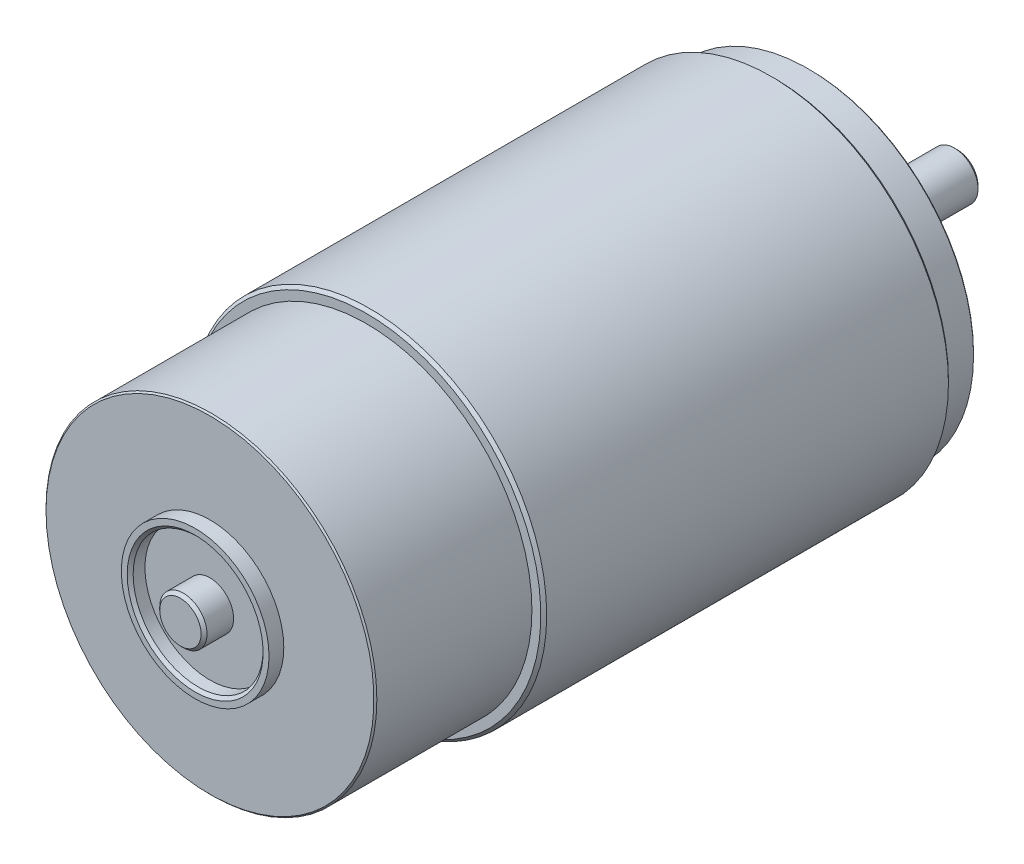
ISO-10303-21;
HEADER;
FILE_DESCRIPTION(('STEP AP214'),'2;1');
FILE_NAME('part.step','',(''),(''),'','','');
FILE_SCHEMA(('AUTOMOTIVE_DESIGN { 1 0 10303 214 1 1 1 1 }'));
ENDSEC;
DATA;
#1=APPLICATION_CONTEXT('core data for automotive mechanical design processes');
#2=APPLICATION_PROTOCOL_DEFINITION('international standard','automotive_design',2000,#1);
#3=PRODUCT_CONTEXT('',#1,'mechanical');
#4=PRODUCT('Part','Part','',(#3));
#5=PRODUCT_RELATED_PRODUCT_CATEGORY('part','',(#4));
#6=PRODUCT_DEFINITION_FORMATION('','',#4);
#7=PRODUCT_DEFINITION_CONTEXT('part definition',#1,'design');
#8=PRODUCT_DEFINITION('design','',#6,#7);
#9=PRODUCT_DEFINITION_SHAPE('','',#8);
#10=(LENGTH_UNIT() NAMED_UNIT(*) SI_UNIT(.MILLI.,.METRE.));
#11=(NAMED_UNIT(*) PLANE_ANGLE_UNIT() SI_UNIT($,.RADIAN.));
#12=(NAMED_UNIT(*) SI_UNIT($,.STERADIAN.) SOLID_ANGLE_UNIT());
#13=UNCERTAINTY_MEASURE_WITH_UNIT(LENGTH_MEASURE(1.E-05),#10,'distance_accuracy_value','');
#14=(GEOMETRIC_REPRESENTATION_CONTEXT(3) GLOBAL_UNCERTAINTY_ASSIGNED_CONTEXT((#13)) GLOBAL_UNIT_ASSIGNED_CONTEXT((#10,
#11,#12)) REPRESENTATION_CONTEXT('',''));
#15=CARTESIAN_POINT('',(0.,0.,0.));
#16=DIRECTION('',(0.,0.,1.));
#17=DIRECTION('',(1.,0.,0.));
#18=AXIS2_PLACEMENT_3D('',#15,#16,#17);
#19=CARTESIAN_POINT('',(-8.53793066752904,0.,81.0483408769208));
#20=DIRECTION('',(0.,0.,-1.));
#21=DIRECTION('',(-1.,0.,0.));
#22=AXIS2_PLACEMENT_3D('',#19,#20,#21);
#23=PLANE('',#22);
#24=CARTESIAN_POINT('',(-8.53793066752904,0.,81.0483408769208));
#25=DIRECTION('',(0.,0.,-1.));
#26=DIRECTION('',(-1.,0.,0.));
#27=AXIS2_PLACEMENT_3D('',#24,#25,#26);
#28=CIRCLE('',#27,3.49999999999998);
#29=CARTESIAN_POINT('',(-12.037930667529,0.,81.0483408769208));
#30=VERTEX_POINT('',#29);
#31=EDGE_CURVE('E51',#30,#30,#28,.F.);
#32=ORIENTED_EDGE('',*,*,#31,.T.);
#33=EDGE_LOOP('',(#32));
#34=FACE_BOUND('',#33,.T.);
#35=ADVANCED_FACE('F28',(#34),#23,.F.);
#36=CARTESIAN_POINT('',(-8.53793066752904,0.,81.0483408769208));
#37=DIRECTION('',(0.,0.,1.));
#38=DIRECTION('',(1.,0.,0.));
#39=AXIS2_PLACEMENT_3D('',#36,#37,#38);
#40=CYLINDRICAL_SURFACE('',#39,4.);
#41=CARTESIAN_POINT('',(-8.53793066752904,0.,80.5483408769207));
#42=DIRECTION('',(0.,0.,-1.));
#43=DIRECTION('',(-1.,0.,0.));
#44=AXIS2_PLACEMENT_3D('',#41,#42,#43);
#45=CIRCLE('',#44,4.);
#46=CARTESIAN_POINT('',(-12.537930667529,0.,80.5483408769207));
#47=VERTEX_POINT('',#46);
#48=EDGE_CURVE('E48',#47,#47,#45,.T.);
#49=ORIENTED_EDGE('',*,*,#48,.T.);
#50=EDGE_LOOP('',(#49));
#51=FACE_BOUND('',#50,.T.);
#52=CARTESIAN_POINT('',(-8.53793066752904,0.,76.0483408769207));
#53=DIRECTION('',(0.,0.,1.));
#54=DIRECTION('',(1.,0.,0.));
#55=AXIS2_PLACEMENT_3D('',#52,#53,#54);
#56=CIRCLE('',#55,4.);
#57=CARTESIAN_POINT('',(-4.53793066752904,0.,76.0483408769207));
#58=VERTEX_POINT('',#57);
#59=EDGE_CURVE('E84',#58,#58,#56,.T.);
#60=ORIENTED_EDGE('',*,*,#59,.T.);
#61=EDGE_LOOP('',(#60));
#62=FACE_BOUND('',#61,.T.);
#63=ADVANCED_FACE('F133',(#51,#62),#40,.T.);
#64=CARTESIAN_POINT('',(-12.537930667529,0.,76.0483408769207));
#65=DIRECTION('',(0.,0.,-1.));
#66=DIRECTION('',(-1.,0.,0.));
#67=AXIS2_PLACEMENT_3D('',#64,#65,#66);
#68=PLANE('',#67);
#69=ORIENTED_EDGE('',*,*,#59,.F.);
#70=EDGE_LOOP('',(#69));
#71=FACE_BOUND('',#70,.T.);
#72=CARTESIAN_POINT('',(-8.53793066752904,0.,76.0483408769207));
#73=DIRECTION('',(0.,0.,1.));
#74=DIRECTION('',(1.,0.,0.));
#75=AXIS2_PLACEMENT_3D('',#72,#73,#74);
#76=CIRCLE('',#75,11.);
#77=CARTESIAN_POINT('',(2.46206933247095,0.,76.0483408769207));
#78=VERTEX_POINT('',#77);
#79=EDGE_CURVE('E87',#78,#78,#76,.T.);
#80=ORIENTED_EDGE('',*,*,#79,.T.);
#81=EDGE_LOOP('',(#80));
#82=FACE_BOUND('',#81,.T.);
#83=ADVANCED_FACE('F139',(#71,#82),#68,.F.);
#84=CARTESIAN_POINT('',(-8.53793066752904,0.,81.0483408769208));
#85=DIRECTION('',(0.,0.,1.));
#86=DIRECTION('',(1.,0.,0.));
#87=AXIS2_PLACEMENT_3D('',#84,#85,#86);
#88=CYLINDRICAL_SURFACE('',#87,11.);
#89=CARTESIAN_POINT('',(-8.53793066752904,0.,78.0483408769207));
#90=DIRECTION('',(0.,0.,-1.));
#91=DIRECTION('',(-1.,0.,0.));
#92=AXIS2_PLACEMENT_3D('',#89,#90,#91);
#93=CIRCLE('',#92,11.);
#94=CARTESIAN_POINT('',(-19.537930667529,0.,78.0483408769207));
#95=VERTEX_POINT('',#94);
#96=EDGE_CURVE('E69',#95,#95,#93,.F.);
#97=ORIENTED_EDGE('',*,*,#96,.T.);
#98=EDGE_LOOP('',(#97));
#99=FACE_BOUND('',#98,.T.);
#100=ORIENTED_EDGE('',*,*,#79,.F.);
#101=EDGE_LOOP('',(#100));
#102=FACE_BOUND('',#101,.T.);
#103=ADVANCED_FACE('F192',(#99,#102),#88,.F.);
#104=CARTESIAN_POINT('',(-19.537930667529,0.,78.5483408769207));
#105=DIRECTION('',(0.,0.,-1.));
#106=DIRECTION('',(-1.,0.,0.));
#107=AXIS2_PLACEMENT_3D('',#104,#105,#106);
#108=PLANE('',#107);
#109=CARTESIAN_POINT('',(-8.53793066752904,0.,78.5483408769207));
#110=DIRECTION('',(0.,0.,-1.));
#111=DIRECTION('',(-1.,0.,0.));
#112=AXIS2_PLACEMENT_3D('',#109,#110,#111);
#113=CIRCLE('',#112,11.5);
#114=CARTESIAN_POINT('',(-20.037930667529,0.,78.5483408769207));
#115=VERTEX_POINT('',#114);
#116=EDGE_CURVE('E66',#115,#115,#113,.T.);
#117=ORIENTED_EDGE('',*,*,#116,.T.);
#118=EDGE_LOOP('',(#117));
#119=FACE_BOUND('',#118,.T.);
#120=CARTESIAN_POINT('',(-8.53793066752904,0.,78.5483408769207));
#121=DIRECTION('',(0.,0.,1.));
#122=DIRECTION('',(1.,0.,0.));
#123=AXIS2_PLACEMENT_3D('',#120,#121,#122);
#124=CIRCLE('',#123,12.5);
#125=CARTESIAN_POINT('',(3.96206933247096,0.,78.5483408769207));
#126=VERTEX_POINT('',#125);
#127=EDGE_CURVE('E90',#126,#126,#124,.T.);
#128=ORIENTED_EDGE('',*,*,#127,.T.);
#129=EDGE_LOOP('',(#128));
#130=FACE_BOUND('',#129,.T.);
#131=ADVANCED_FACE('F186',(#119,#130),#108,.F.);
#132=CARTESIAN_POINT('',(-8.53793066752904,0.,81.0483408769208));
#133=DIRECTION('',(0.,0.,1.));
#134=DIRECTION('',(1.,0.,0.));
#135=AXIS2_PLACEMENT_3D('',#132,#133,#134);
#136=CYLINDRICAL_SURFACE('',#135,12.5);
#137=ORIENTED_EDGE('',*,*,#127,.F.);
#138=EDGE_LOOP('',(#137));
#139=FACE_BOUND('',#138,.T.);
#140=CARTESIAN_POINT('',(-8.53793066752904,0.,76.0483408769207));
#141=DIRECTION('',(0.,0.,1.));
#142=DIRECTION('',(1.,0.,0.));
#143=AXIS2_PLACEMENT_3D('',#140,#141,#142);
#144=CIRCLE('',#143,12.5);
#145=CARTESIAN_POINT('',(3.96206933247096,0.,76.0483408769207));
#146=VERTEX_POINT('',#145);
#147=EDGE_CURVE('E93',#146,#146,#144,.T.);
#148=ORIENTED_EDGE('',*,*,#147,.T.);
#149=EDGE_LOOP('',(#148));
#150=FACE_BOUND('',#149,.T.);
#151=ADVANCED_FACE('F181',(#139,#150),#136,.T.);
#152=CARTESIAN_POINT('',(-21.037930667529,0.,76.0483408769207));
#153=DIRECTION('',(0.,0.,-1.));
#154=DIRECTION('',(-1.,0.,0.));
#155=AXIS2_PLACEMENT_3D('',#152,#153,#154);
#156=PLANE('',#155);
#157=CARTESIAN_POINT('',(-8.53793066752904,0.,76.0483408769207));
#158=DIRECTION('',(0.,0.,-1.));
#159=DIRECTION('',(-1.,0.,0.));
#160=AXIS2_PLACEMENT_3D('',#157,#158,#159);
#161=CIRCLE('',#160,27.75);
#162=CARTESIAN_POINT('',(-36.287930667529,0.,76.0483408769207));
#163=VERTEX_POINT('',#162);
#164=EDGE_CURVE('E43',#163,#163,#161,.F.);
#165=ORIENTED_EDGE('',*,*,#164,.T.);
#166=EDGE_LOOP('',(#165));
#167=FACE_BOUND('',#166,.T.);
#168=ORIENTED_EDGE('',*,*,#147,.F.);
#169=EDGE_LOOP('',(#168));
#170=FACE_BOUND('',#169,.T.);
#171=ADVANCED_FACE('F177',(#167,#170),#156,.F.);
#172=CARTESIAN_POINT('',(-8.53793066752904,0.,81.0483408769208));
#173=DIRECTION('',(0.,0.,1.));
#174=DIRECTION('',(1.,0.,0.));
#175=AXIS2_PLACEMENT_3D('',#172,#173,#174);
#176=CYLINDRICAL_SURFACE('',#175,28.);
#177=CARTESIAN_POINT('',(-8.53793066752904,0.,75.7983408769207));
#178=DIRECTION('',(0.,0.,-1.));
#179=DIRECTION('',(-1.,0.,0.));
#180=AXIS2_PLACEMENT_3D('',#177,#178,#179);
#181=CIRCLE('',#180,28.);
#182=CARTESIAN_POINT('',(-36.537930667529,0.,75.7983408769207));
#183=VERTEX_POINT('',#182);
#184=EDGE_CURVE('E39',#183,#183,#181,.T.);
#185=ORIENTED_EDGE('',*,*,#184,.T.);
#186=EDGE_LOOP('',(#185));
#187=FACE_BOUND('',#186,.T.);
#188=CARTESIAN_POINT('',(-8.53793066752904,0.,49.5483408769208));
#189=DIRECTION('',(0.,0.,1.));
#190=DIRECTION('',(1.,0.,0.));
#191=AXIS2_PLACEMENT_3D('',#188,#189,#190);
#192=CIRCLE('',#191,28.);
#193=CARTESIAN_POINT('',(19.462069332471,0.,49.5483408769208));
#194=VERTEX_POINT('',#193);
#195=EDGE_CURVE('E96',#194,#194,#192,.T.);
#196=ORIENTED_EDGE('',*,*,#195,.T.);
#197=EDGE_LOOP('',(#196));
#198=FACE_BOUND('',#197,.T.);
#199=ADVANCED_FACE('F180',(#187,#198),#176,.T.);
#200=CARTESIAN_POINT('',(-36.537930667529,0.,49.5483408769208));
#201=DIRECTION('',(0.,0.,-1.));
#202=DIRECTION('',(-1.,0.,0.));
#203=AXIS2_PLACEMENT_3D('',#200,#201,#202);
#204=PLANE('',#203);
#205=CARTESIAN_POINT('',(-8.53793066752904,0.,49.5483408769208));
#206=DIRECTION('',(0.,0.,-1.));
#207=DIRECTION('',(-1.,0.,0.));
#208=AXIS2_PLACEMENT_3D('',#205,#206,#207);
#209=CIRCLE('',#208,29.5);
#210=CARTESIAN_POINT('',(-38.0379306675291,0.,49.5483408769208));
#211=VERTEX_POINT('',#210);
#212=EDGE_CURVE('E72',#211,#211,#209,.F.);
#213=ORIENTED_EDGE('',*,*,#212,.T.);
#214=EDGE_LOOP('',(#213));
#215=FACE_BOUND('',#214,.T.);
#216=ORIENTED_EDGE('',*,*,#195,.F.);
#217=EDGE_LOOP('',(#216));
#218=FACE_BOUND('',#217,.T.);
#219=ADVANCED_FACE('F304',(#215,#218),#204,.F.);
#220=CARTESIAN_POINT('',(-8.53793066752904,0.,81.0483408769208));
#221=DIRECTION('',(0.,0.,1.));
#222=DIRECTION('',(1.,0.,0.));
#223=AXIS2_PLACEMENT_3D('',#220,#221,#222);
#224=CYLINDRICAL_SURFACE('',#223,30.);
#225=CARTESIAN_POINT('',(-8.53793066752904,0.,-18.9516591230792));
#226=DIRECTION('',(0.,0.,1.));
#227=DIRECTION('',(1.,0.,0.));
#228=AXIS2_PLACEMENT_3D('',#225,#226,#227);
#229=CIRCLE('',#228,30.);
#230=CARTESIAN_POINT('',(21.462069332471,0.,-18.9516591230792));
#231=VERTEX_POINT('',#230);
#232=EDGE_CURVE('E78',#231,#231,#229,.T.);
#233=ORIENTED_EDGE('',*,*,#232,.T.);
#234=EDGE_LOOP('',(#233));
#235=FACE_BOUND('',#234,.T.);
#236=CARTESIAN_POINT('',(-8.53793066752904,0.,49.0483408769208));
#237=DIRECTION('',(0.,0.,-1.));
#238=DIRECTION('',(-1.,0.,0.));
#239=AXIS2_PLACEMENT_3D('',#236,#237,#238);
#240=CIRCLE('',#239,30.);
#241=CARTESIAN_POINT('',(-38.537930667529,0.,49.0483408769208));
#242=VERTEX_POINT('',#241);
#243=EDGE_CURVE('E81',#242,#242,#240,.T.);
#244=ORIENTED_EDGE('',*,*,#243,.T.);
#245=EDGE_LOOP('',(#244));
#246=FACE_BOUND('',#245,.T.);
#247=ADVANCED_FACE('F356',(#235,#246),#224,.T.);
#248=CARTESIAN_POINT('',(-38.537930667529,0.,-19.4516591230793));
#249=DIRECTION('',(0.,0.,1.));
#250=DIRECTION('',(1.,0.,0.));
#251=AXIS2_PLACEMENT_3D('',#248,#249,#250);
#252=PLANE('',#251);
#253=CARTESIAN_POINT('',(-8.53793066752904,0.,-19.4516591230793));
#254=DIRECTION('',(0.,0.,1.));
#255=DIRECTION('',(1.,0.,0.));
#256=AXIS2_PLACEMENT_3D('',#253,#254,#255);
#257=CIRCLE('',#256,29.5);
#258=CARTESIAN_POINT('',(20.962069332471,0.,-19.4516591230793));
#259=VERTEX_POINT('',#258);
#260=EDGE_CURVE('E75',#259,#259,#257,.F.);
#261=ORIENTED_EDGE('',*,*,#260,.T.);
#262=EDGE_LOOP('',(#261));
#263=FACE_BOUND('',#262,.T.);
#264=CARTESIAN_POINT('',(-8.53793066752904,0.,-19.4516591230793));
#265=DIRECTION('',(0.,0.,1.));
#266=DIRECTION('',(1.,0.,0.));
#267=AXIS2_PLACEMENT_3D('',#264,#265,#266);
#268=CIRCLE('',#267,28.);
#269=CARTESIAN_POINT('',(19.462069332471,0.,-19.4516591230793));
#270=VERTEX_POINT('',#269);
#271=EDGE_CURVE('E99',#270,#270,#268,.T.);
#272=ORIENTED_EDGE('',*,*,#271,.T.);
#273=EDGE_LOOP('',(#272));
#274=FACE_BOUND('',#273,.T.);
#275=ADVANCED_FACE('F317',(#263,#274),#252,.F.);
#276=CARTESIAN_POINT('',(-8.53793066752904,0.,81.0483408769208));
#277=DIRECTION('',(0.,0.,1.));
#278=DIRECTION('',(1.,0.,0.));
#279=AXIS2_PLACEMENT_3D('',#276,#277,#278);
#280=CYLINDRICAL_SURFACE('',#279,28.);
#281=CARTESIAN_POINT('',(-8.53793066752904,0.,-25.2016591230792));
#282=DIRECTION('',(0.,0.,1.));
#283=DIRECTION('',(1.,0.,0.));
#284=AXIS2_PLACEMENT_3D('',#281,#282,#283);
#285=CIRCLE('',#284,28.);
#286=CARTESIAN_POINT('',(19.462069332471,0.,-25.2016591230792));
#287=VERTEX_POINT('',#286);
#288=EDGE_CURVE('E35',#287,#287,#285,.T.);
#289=ORIENTED_EDGE('',*,*,#288,.T.);
#290=EDGE_LOOP('',(#289));
#291=FACE_BOUND('',#290,.T.);
#292=ORIENTED_EDGE('',*,*,#271,.F.);
#293=EDGE_LOOP('',(#292));
#294=FACE_BOUND('',#293,.T.);
#295=ADVANCED_FACE('F311',(#291,#294),#280,.T.);
#296=CARTESIAN_POINT('',(-36.537930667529,0.,-25.4516591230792));
#297=DIRECTION('',(0.,0.,1.));
#298=DIRECTION('',(1.,0.,0.));
#299=AXIS2_PLACEMENT_3D('',#296,#297,#298);
#300=PLANE('',#299);
#301=CARTESIAN_POINT('',(-8.53793066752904,0.,-25.4516591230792));
#302=DIRECTION('',(0.,0.,1.));
#303=DIRECTION('',(1.,0.,0.));
#304=AXIS2_PLACEMENT_3D('',#301,#302,#303);
#305=CIRCLE('',#304,27.75);
#306=CARTESIAN_POINT('',(19.2120693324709,0.,-25.4516591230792));
#307=VERTEX_POINT('',#306);
#308=EDGE_CURVE('E10',#307,#307,#305,.F.);
#309=ORIENTED_EDGE('',*,*,#308,.T.);
#310=EDGE_LOOP('',(#309));
#311=FACE_BOUND('',#310,.T.);
#312=CARTESIAN_POINT('',(-8.53793066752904,0.,-25.4516591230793));
#313=DIRECTION('',(0.,0.,1.));
#314=DIRECTION('',(1.,0.,0.));
#315=AXIS2_PLACEMENT_3D('',#312,#313,#314);
#316=CIRCLE('',#315,12.5);
#317=CARTESIAN_POINT('',(3.96206933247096,0.,-25.4516591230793));
#318=VERTEX_POINT('',#317);
#319=EDGE_CURVE('E102',#318,#318,#316,.T.);
#320=ORIENTED_EDGE('',*,*,#319,.T.);
#321=EDGE_LOOP('',(#320));
#322=FACE_BOUND('',#321,.T.);
#323=ADVANCED_FACE('F316',(#311,#322),#300,.F.);
#324=CARTESIAN_POINT('',(-8.53793066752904,0.,81.0483408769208));
#325=DIRECTION('',(0.,0.,1.));
#326=DIRECTION('',(1.,0.,0.));
#327=AXIS2_PLACEMENT_3D('',#324,#325,#326);
#328=CYLINDRICAL_SURFACE('',#327,12.5);
#329=ORIENTED_EDGE('',*,*,#319,.F.);
#330=EDGE_LOOP('',(#329));
#331=FACE_BOUND('',#330,.T.);
#332=CARTESIAN_POINT('',(-8.53793066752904,0.,-27.9516591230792));
#333=DIRECTION('',(0.,0.,1.));
#334=DIRECTION('',(1.,0.,0.));
#335=AXIS2_PLACEMENT_3D('',#332,#333,#334);
#336=CIRCLE('',#335,12.5);
#337=CARTESIAN_POINT('',(3.96206933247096,0.,-27.9516591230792));
#338=VERTEX_POINT('',#337);
#339=EDGE_CURVE('E105',#338,#338,#336,.T.);
#340=ORIENTED_EDGE('',*,*,#339,.T.);
#341=EDGE_LOOP('',(#340));
#342=FACE_BOUND('',#341,.T.);
#343=ADVANCED_FACE('F231',(#331,#342),#328,.T.);
#344=CARTESIAN_POINT('',(-21.037930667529,0.,-27.9516591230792));
#345=DIRECTION('',(0.,0.,1.));
#346=DIRECTION('',(1.,0.,0.));
#347=AXIS2_PLACEMENT_3D('',#344,#345,#346);
#348=PLANE('',#347);
#349=CARTESIAN_POINT('',(-8.53793066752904,0.,-27.9516591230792));
#350=DIRECTION('',(0.,0.,1.));
#351=DIRECTION('',(1.,0.,0.));
#352=AXIS2_PLACEMENT_3D('',#349,#350,#351);
#353=CIRCLE('',#352,11.5);
#354=CARTESIAN_POINT('',(2.96206933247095,0.,-27.9516591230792));
#355=VERTEX_POINT('',#354);
#356=EDGE_CURVE('E63',#355,#355,#353,.T.);
#357=ORIENTED_EDGE('',*,*,#356,.T.);
#358=EDGE_LOOP('',(#357));
#359=FACE_BOUND('',#358,.T.);
#360=ORIENTED_EDGE('',*,*,#339,.F.);
#361=EDGE_LOOP('',(#360));
#362=FACE_BOUND('',#361,.T.);
#363=ADVANCED_FACE('F226',(#359,#362),#348,.F.);
#364=CARTESIAN_POINT('',(-8.53793066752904,0.,81.0483408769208));
#365=DIRECTION('',(0.,0.,1.));
#366=DIRECTION('',(1.,0.,0.));
#367=AXIS2_PLACEMENT_3D('',#364,#365,#366);
#368=CYLINDRICAL_SURFACE('',#367,11.);
#369=CARTESIAN_POINT('',(-8.53793066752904,0.,-27.4516591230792));
#370=DIRECTION('',(0.,0.,1.));
#371=DIRECTION('',(1.,0.,0.));
#372=AXIS2_PLACEMENT_3D('',#369,#370,#371);
#373=CIRCLE('',#372,11.);
#374=CARTESIAN_POINT('',(2.46206933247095,0.,-27.4516591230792));
#375=VERTEX_POINT('',#374);
#376=EDGE_CURVE('E60',#375,#375,#373,.F.);
#377=ORIENTED_EDGE('',*,*,#376,.T.);
#378=EDGE_LOOP('',(#377));
#379=FACE_BOUND('',#378,.T.);
#380=CARTESIAN_POINT('',(-8.53793066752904,0.,-25.4516591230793));
#381=DIRECTION('',(0.,0.,1.));
#382=DIRECTION('',(1.,0.,0.));
#383=AXIS2_PLACEMENT_3D('',#380,#381,#382);
#384=CIRCLE('',#383,11.);
#385=CARTESIAN_POINT('',(2.46206933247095,0.,-25.4516591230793));
#386=VERTEX_POINT('',#385);
#387=EDGE_CURVE('E108',#386,#386,#384,.T.);
#388=ORIENTED_EDGE('',*,*,#387,.T.);
#389=EDGE_LOOP('',(#388));
#390=FACE_BOUND('',#389,.T.);
#391=ADVANCED_FACE('F129',(#379,#390),#368,.F.);
#392=CARTESIAN_POINT('',(-19.537930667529,0.,-25.4516591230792));
#393=DIRECTION('',(0.,0.,1.));
#394=DIRECTION('',(1.,0.,0.));
#395=AXIS2_PLACEMENT_3D('',#392,#393,#394);
#396=PLANE('',#395);
#397=ORIENTED_EDGE('',*,*,#387,.F.);
#398=EDGE_LOOP('',(#397));
#399=FACE_BOUND('',#398,.T.);
#400=CARTESIAN_POINT('',(-8.53793066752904,0.,-25.4516591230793));
#401=DIRECTION('',(0.,0.,1.));
#402=DIRECTION('',(1.,0.,0.));
#403=AXIS2_PLACEMENT_3D('',#400,#401,#402);
#404=CIRCLE('',#403,4.);
#405=CARTESIAN_POINT('',(-4.53793066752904,0.,-25.4516591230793));
#406=VERTEX_POINT('',#405);
#407=EDGE_CURVE('E111',#406,#406,#404,.T.);
#408=ORIENTED_EDGE('',*,*,#407,.T.);
#409=EDGE_LOOP('',(#408));
#410=FACE_BOUND('',#409,.T.);
#411=ADVANCED_FACE('F115',(#399,#410),#396,.F.);
#412=CARTESIAN_POINT('',(-8.53793066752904,0.,81.0483408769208));
#413=DIRECTION('',(0.,0.,1.));
#414=DIRECTION('',(1.,0.,0.));
#415=AXIS2_PLACEMENT_3D('',#412,#413,#414);
#416=CYLINDRICAL_SURFACE('',#415,4.);
#417=CARTESIAN_POINT('',(-8.53793066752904,0.,-49.9516591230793));
#418=DIRECTION('',(0.,0.,1.));
#419=DIRECTION('',(1.,0.,0.));
#420=AXIS2_PLACEMENT_3D('',#417,#418,#419);
#421=CIRCLE('',#420,4.);
#422=CARTESIAN_POINT('',(-4.53793066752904,0.,-49.9516591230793));
#423=VERTEX_POINT('',#422);
#424=EDGE_CURVE('E57',#423,#423,#421,.T.);
#425=ORIENTED_EDGE('',*,*,#424,.T.);
#426=EDGE_LOOP('',(#425));
#427=FACE_BOUND('',#426,.T.);
#428=ORIENTED_EDGE('',*,*,#407,.F.);
#429=EDGE_LOOP('',(#428));
#430=FACE_BOUND('',#429,.T.);
#431=ADVANCED_FACE('F117',(#427,#430),#416,.T.);
#432=CARTESIAN_POINT('',(-12.537930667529,0.,-50.4516591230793));
#433=DIRECTION('',(0.,0.,1.));
#434=DIRECTION('',(1.,0.,0.));
#435=AXIS2_PLACEMENT_3D('',#432,#433,#434);
#436=PLANE('',#435);
#437=CARTESIAN_POINT('',(-8.53793066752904,0.,-50.4516591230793));
#438=DIRECTION('',(0.,0.,1.));
#439=DIRECTION('',(1.,0.,0.));
#440=AXIS2_PLACEMENT_3D('',#437,#438,#439);
#441=CIRCLE('',#440,3.50000000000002);
#442=CARTESIAN_POINT('',(-5.03793066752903,0.,-50.4516591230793));
#443=VERTEX_POINT('',#442);
#444=EDGE_CURVE('E54',#443,#443,#441,.F.);
#445=ORIENTED_EDGE('',*,*,#444,.T.);
#446=EDGE_LOOP('',(#445));
#447=FACE_BOUND('',#446,.T.);
#448=ADVANCED_FACE('F119',(#447),#436,.F.);
#449=CARTESIAN_POINT('',(-8.53793066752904,0.,-18.9516591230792));
#450=DIRECTION('',(0.,0.,1.));
#451=DIRECTION('',(1.,0.,0.));
#452=AXIS2_PLACEMENT_3D('',#449,#450,#451);
#453=CONICAL_SURFACE('',#452,30.,0.785398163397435);
#454=ORIENTED_EDGE('',*,*,#260,.F.);
#455=EDGE_LOOP('',(#454));
#456=FACE_BOUND('',#455,.T.);
#457=ORIENTED_EDGE('',*,*,#232,.F.);
#458=EDGE_LOOP('',(#457));
#459=FACE_BOUND('',#458,.T.);
#460=ADVANCED_FACE('F126',(#456,#459),#453,.T.);
#461=CARTESIAN_POINT('',(-8.53793066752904,0.,49.5483408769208));
#462=DIRECTION('',(0.,0.,-1.));
#463=DIRECTION('',(-1.,0.,0.));
#464=AXIS2_PLACEMENT_3D('',#461,#462,#463);
#465=CONICAL_SURFACE('',#464,29.5,0.785398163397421);
#466=ORIENTED_EDGE('',*,*,#243,.F.);
#467=EDGE_LOOP('',(#466));
#468=FACE_BOUND('',#467,.T.);
#469=ORIENTED_EDGE('',*,*,#212,.F.);
#470=EDGE_LOOP('',(#469));
#471=FACE_BOUND('',#470,.T.);
#472=ADVANCED_FACE('F146',(#468,#471),#465,.T.);
#473=CARTESIAN_POINT('',(-8.53793066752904,0.,78.0483408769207));
#474=DIRECTION('',(0.,0.,1.));
#475=DIRECTION('',(1.,0.,0.));
#476=AXIS2_PLACEMENT_3D('',#473,#474,#475);
#477=CONICAL_SURFACE('',#476,11.,0.785398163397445);
#478=ORIENTED_EDGE('',*,*,#116,.F.);
#479=EDGE_LOOP('',(#478));
#480=FACE_BOUND('',#479,.T.);
#481=ORIENTED_EDGE('',*,*,#96,.F.);
#482=EDGE_LOOP('',(#481));
#483=FACE_BOUND('',#482,.T.);
#484=ADVANCED_FACE('F150',(#480,#483),#477,.F.);
#485=CARTESIAN_POINT('',(-8.53793066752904,0.,-27.9516591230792));
#486=DIRECTION('',(0.,0.,-1.));
#487=DIRECTION('',(-1.,0.,0.));
#488=AXIS2_PLACEMENT_3D('',#485,#486,#487);
#489=CONICAL_SURFACE('',#488,11.5,0.785398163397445);
#490=ORIENTED_EDGE('',*,*,#376,.F.);
#491=EDGE_LOOP('',(#490));
#492=FACE_BOUND('',#491,.T.);
#493=ORIENTED_EDGE('',*,*,#356,.F.);
#494=EDGE_LOOP('',(#493));
#495=FACE_BOUND('',#494,.T.);
#496=ADVANCED_FACE('F154',(#492,#495),#489,.F.);
#497=CARTESIAN_POINT('',(-8.53793066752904,0.,-49.9516591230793));
#498=DIRECTION('',(0.,0.,1.));
#499=DIRECTION('',(1.,0.,0.));
#500=AXIS2_PLACEMENT_3D('',#497,#498,#499);
#501=CONICAL_SURFACE('',#500,4.,0.785398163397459);
#502=ORIENTED_EDGE('',*,*,#444,.F.);
#503=EDGE_LOOP('',(#502));
#504=FACE_BOUND('',#503,.T.);
#505=ORIENTED_EDGE('',*,*,#424,.F.);
#506=EDGE_LOOP('',(#505));
#507=FACE_BOUND('',#506,.T.);
#508=ADVANCED_FACE('F158',(#504,#507),#501,.T.);
#509=CARTESIAN_POINT('',(-8.53793066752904,0.,81.0483408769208));
#510=DIRECTION('',(0.,0.,-1.));
#511=DIRECTION('',(-1.,0.,0.));
#512=AXIS2_PLACEMENT_3D('',#509,#510,#511);
#513=CONICAL_SURFACE('',#512,3.49999999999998,0.785398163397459);
#514=ORIENTED_EDGE('',*,*,#48,.F.);
#515=EDGE_LOOP('',(#514));
#516=FACE_BOUND('',#515,.T.);
#517=ORIENTED_EDGE('',*,*,#31,.F.);
#518=EDGE_LOOP('',(#517));
#519=FACE_BOUND('',#518,.T.);
#520=ADVANCED_FACE('F162',(#516,#519),#513,.T.);
#521=CARTESIAN_POINT('',(-8.53793066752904,0.,76.0483408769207));
#522=DIRECTION('',(0.,0.,-1.));
#523=DIRECTION('',(-1.,0.,0.));
#524=AXIS2_PLACEMENT_3D('',#521,#522,#523);
#525=CONICAL_SURFACE('',#524,27.75,0.785398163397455);
#526=ORIENTED_EDGE('',*,*,#184,.F.);
#527=EDGE_LOOP('',(#526));
#528=FACE_BOUND('',#527,.T.);
#529=ORIENTED_EDGE('',*,*,#164,.F.);
#530=EDGE_LOOP('',(#529));
#531=FACE_BOUND('',#530,.T.);
#532=ADVANCED_FACE('F165',(#528,#531),#525,.T.);
#533=CARTESIAN_POINT('',(-8.53793066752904,0.,-25.2016591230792));
#534=DIRECTION('',(0.,0.,1.));
#535=DIRECTION('',(1.,0.,0.));
#536=AXIS2_PLACEMENT_3D('',#533,#534,#535);
#537=CONICAL_SURFACE('',#536,28.,0.785398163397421);
#538=ORIENTED_EDGE('',*,*,#308,.F.);
#539=EDGE_LOOP('',(#538));
#540=FACE_BOUND('',#539,.T.);
#541=ORIENTED_EDGE('',*,*,#288,.F.);
#542=EDGE_LOOP('',(#541));
#543=FACE_BOUND('',#542,.T.);
#544=ADVANCED_FACE('F30',(#540,#543),#537,.T.);
#545=CLOSED_SHELL('',(#35,#63,#83,#103,#131,#151,#171,#199,#219,#247,#275,#295,#323,#343,#363,
#391,#411,#431,#448,#460,#472,#484,#496,#508,#520,#532,#544));
#546=MANIFOLD_SOLID_BREP('B2',#545);
#547=ADVANCED_BREP_SHAPE_REPRESENTATION('',(#18,#546),#14);
#548=SHAPE_DEFINITION_REPRESENTATION(#9,#547);
ENDSEC;
END-ISO-10303-21;
